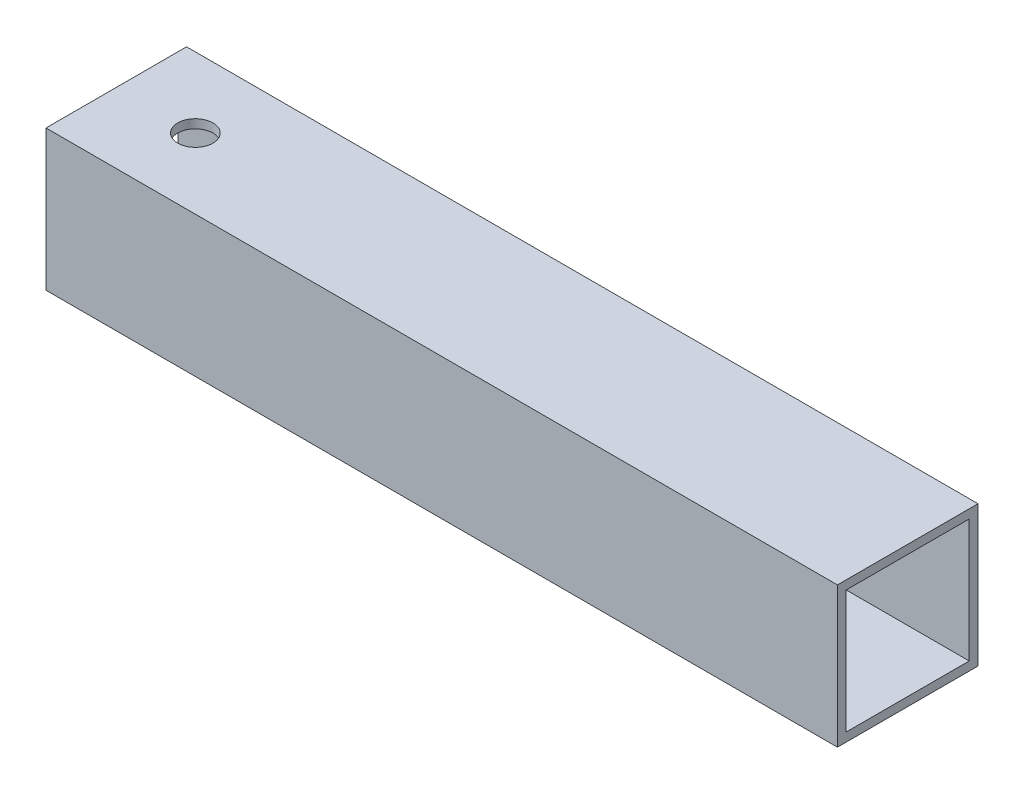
ISO-10303-21;
HEADER;
FILE_DESCRIPTION(('STEP AP214'),'2;1');
FILE_NAME('part.step','',(''),(''),'','','');
FILE_SCHEMA(('AUTOMOTIVE_DESIGN { 1 0 10303 214 1 1 1 1 }'));
ENDSEC;
DATA;
#1=APPLICATION_CONTEXT('core data for automotive mechanical design processes');
#2=APPLICATION_PROTOCOL_DEFINITION('international standard','automotive_design',2000,#1);
#3=PRODUCT_CONTEXT('',#1,'mechanical');
#4=PRODUCT('Part','Part','',(#3));
#5=PRODUCT_RELATED_PRODUCT_CATEGORY('part','',(#4));
#6=PRODUCT_DEFINITION_FORMATION('','',#4);
#7=PRODUCT_DEFINITION_CONTEXT('part definition',#1,'design');
#8=PRODUCT_DEFINITION('design','',#6,#7);
#9=PRODUCT_DEFINITION_SHAPE('','',#8);
#10=(LENGTH_UNIT() NAMED_UNIT(*) SI_UNIT(.MILLI.,.METRE.));
#11=(NAMED_UNIT(*) PLANE_ANGLE_UNIT() SI_UNIT($,.RADIAN.));
#12=(NAMED_UNIT(*) SI_UNIT($,.STERADIAN.) SOLID_ANGLE_UNIT());
#13=UNCERTAINTY_MEASURE_WITH_UNIT(LENGTH_MEASURE(1.E-05),#10,'distance_accuracy_value','');
#14=(GEOMETRIC_REPRESENTATION_CONTEXT(3) GLOBAL_UNCERTAINTY_ASSIGNED_CONTEXT((#13)) GLOBAL_UNIT_ASSIGNED_CONTEXT((#10,
#11,#12)) REPRESENTATION_CONTEXT('',''));
#15=CARTESIAN_POINT('',(0.,0.,0.));
#16=DIRECTION('',(0.,0.,1.));
#17=DIRECTION('',(1.,0.,0.));
#18=AXIS2_PLACEMENT_3D('',#15,#16,#17);
#19=CARTESIAN_POINT('',(143.002,0.,0.));
#20=DIRECTION('',(1.,0.,0.));
#21=DIRECTION('',(0.,0.,-1.));
#22=AXIS2_PLACEMENT_3D('',#19,#20,#21);
#23=PLANE('',#22);
#24=DIRECTION('',(0.,-1.,0.));
#25=VECTOR('',#24,1.);
#26=CARTESIAN_POINT('',(143.002,-12.7,12.7));
#27=LINE('',#26,#25);
#28=CARTESIAN_POINT('',(143.002,12.7,12.7));
#29=VERTEX_POINT('',#28);
#30=CARTESIAN_POINT('',(143.002,-12.7,12.7));
#31=VERTEX_POINT('',#30);
#32=EDGE_CURVE('E137',#29,#31,#27,.T.);
#33=ORIENTED_EDGE('',*,*,#32,.T.);
#34=DIRECTION('',(0.,0.,-1.));
#35=VECTOR('',#34,1.);
#36=CARTESIAN_POINT('',(143.002,-12.7,-12.7));
#37=LINE('',#36,#35);
#38=CARTESIAN_POINT('',(143.002,-12.7,-12.7));
#39=VERTEX_POINT('',#38);
#40=EDGE_CURVE('E140',#31,#39,#37,.T.);
#41=ORIENTED_EDGE('',*,*,#40,.T.);
#42=DIRECTION('',(0.,1.,0.));
#43=VECTOR('',#42,1.);
#44=CARTESIAN_POINT('',(143.002,-12.7,-12.7));
#45=LINE('',#44,#43);
#46=CARTESIAN_POINT('',(143.002,12.7,-12.7));
#47=VERTEX_POINT('',#46);
#48=EDGE_CURVE('E143',#39,#47,#45,.T.);
#49=ORIENTED_EDGE('',*,*,#48,.T.);
#50=DIRECTION('',(0.,0.,1.));
#51=VECTOR('',#50,1.);
#52=CARTESIAN_POINT('',(143.002,12.7,-12.7));
#53=LINE('',#52,#51);
#54=EDGE_CURVE('E145',#47,#29,#53,.T.);
#55=ORIENTED_EDGE('',*,*,#54,.T.);
#56=EDGE_LOOP('',(#33,#41,#49,#55));
#57=FACE_BOUND('',#56,.T.);
#58=DIRECTION('',(0.,0.,-1.));
#59=VECTOR('',#58,1.);
#60=CARTESIAN_POINT('',(143.002,-11.1125,-11.1125));
#61=LINE('',#60,#59);
#62=CARTESIAN_POINT('',(143.002,-11.1125,11.1125));
#63=VERTEX_POINT('',#62);
#64=CARTESIAN_POINT('',(143.002,-11.1125,-11.1125));
#65=VERTEX_POINT('',#64);
#66=EDGE_CURVE('E107',#63,#65,#61,.T.);
#67=ORIENTED_EDGE('',*,*,#66,.F.);
#68=DIRECTION('',(0.,-1.,0.));
#69=VECTOR('',#68,1.);
#70=CARTESIAN_POINT('',(143.002,-11.1125,11.1125));
#71=LINE('',#70,#69);
#72=CARTESIAN_POINT('',(143.002,11.1125,11.1125));
#73=VERTEX_POINT('',#72);
#74=EDGE_CURVE('E99',#73,#63,#71,.T.);
#75=ORIENTED_EDGE('',*,*,#74,.F.);
#76=DIRECTION('',(0.,0.,1.));
#77=VECTOR('',#76,1.);
#78=CARTESIAN_POINT('',(143.002,11.1125,-11.1125));
#79=LINE('',#78,#77);
#80=CARTESIAN_POINT('',(143.002,11.1125,-11.1125));
#81=VERTEX_POINT('',#80);
#82=EDGE_CURVE('E121',#81,#73,#79,.T.);
#83=ORIENTED_EDGE('',*,*,#82,.F.);
#84=DIRECTION('',(0.,1.,0.));
#85=VECTOR('',#84,1.);
#86=CARTESIAN_POINT('',(143.002,-11.1125,-11.1125));
#87=LINE('',#86,#85);
#88=EDGE_CURVE('E119',#65,#81,#87,.T.);
#89=ORIENTED_EDGE('',*,*,#88,.F.);
#90=EDGE_LOOP('',(#67,#75,#83,#89));
#91=FACE_BOUND('',#90,.T.);
#92=ADVANCED_FACE('F33',(#57,#91),#23,.T.);
#93=CARTESIAN_POINT('',(0.,0.,0.));
#94=DIRECTION('',(1.,0.,0.));
#95=DIRECTION('',(0.,0.,-1.));
#96=AXIS2_PLACEMENT_3D('',#93,#94,#95);
#97=PLANE('',#96);
#98=DIRECTION('',(0.,-1.,0.));
#99=VECTOR('',#98,1.);
#100=CARTESIAN_POINT('',(0.,-12.7,12.7));
#101=LINE('',#100,#99);
#102=CARTESIAN_POINT('',(0.,12.7,12.7));
#103=VERTEX_POINT('',#102);
#104=CARTESIAN_POINT('',(0.,-12.7,12.7));
#105=VERTEX_POINT('',#104);
#106=EDGE_CURVE('E115',#103,#105,#101,.T.);
#107=ORIENTED_EDGE('',*,*,#106,.F.);
#108=DIRECTION('',(0.,0.,1.));
#109=VECTOR('',#108,1.);
#110=CARTESIAN_POINT('',(0.,12.7,-12.7));
#111=LINE('',#110,#109);
#112=CARTESIAN_POINT('',(0.,12.7,-12.7));
#113=VERTEX_POINT('',#112);
#114=EDGE_CURVE('E141',#113,#103,#111,.T.);
#115=ORIENTED_EDGE('',*,*,#114,.F.);
#116=DIRECTION('',(0.,1.,0.));
#117=VECTOR('',#116,1.);
#118=CARTESIAN_POINT('',(0.,-12.7,-12.7));
#119=LINE('',#118,#117);
#120=CARTESIAN_POINT('',(0.,-12.7,-12.7));
#121=VERTEX_POINT('',#120);
#122=EDGE_CURVE('E152',#121,#113,#119,.T.);
#123=ORIENTED_EDGE('',*,*,#122,.F.);
#124=DIRECTION('',(0.,0.,-1.));
#125=VECTOR('',#124,1.);
#126=CARTESIAN_POINT('',(0.,-12.7,-12.7));
#127=LINE('',#126,#125);
#128=EDGE_CURVE('E150',#105,#121,#127,.T.);
#129=ORIENTED_EDGE('',*,*,#128,.F.);
#130=EDGE_LOOP('',(#107,#115,#123,#129));
#131=FACE_BOUND('',#130,.T.);
#132=DIRECTION('',(0.,-1.,0.));
#133=VECTOR('',#132,1.);
#134=CARTESIAN_POINT('',(0.,-11.1125,11.1125));
#135=LINE('',#134,#133);
#136=CARTESIAN_POINT('',(0.,11.1125,11.1125));
#137=VERTEX_POINT('',#136);
#138=CARTESIAN_POINT('',(0.,-11.1125,11.1125));
#139=VERTEX_POINT('',#138);
#140=EDGE_CURVE('E57',#137,#139,#135,.T.);
#141=ORIENTED_EDGE('',*,*,#140,.T.);
#142=DIRECTION('',(0.,0.,-1.));
#143=VECTOR('',#142,1.);
#144=CARTESIAN_POINT('',(0.,-11.1125,-11.1125));
#145=LINE('',#144,#143);
#146=CARTESIAN_POINT('',(0.,-11.1125,-11.1125));
#147=VERTEX_POINT('',#146);
#148=EDGE_CURVE('E114',#139,#147,#145,.T.);
#149=ORIENTED_EDGE('',*,*,#148,.T.);
#150=DIRECTION('',(0.,1.,0.));
#151=VECTOR('',#150,1.);
#152=CARTESIAN_POINT('',(0.,-11.1125,-11.1125));
#153=LINE('',#152,#151);
#154=CARTESIAN_POINT('',(0.,11.1125,-11.1125));
#155=VERTEX_POINT('',#154);
#156=EDGE_CURVE('E129',#147,#155,#153,.T.);
#157=ORIENTED_EDGE('',*,*,#156,.T.);
#158=DIRECTION('',(0.,0.,1.));
#159=VECTOR('',#158,1.);
#160=CARTESIAN_POINT('',(0.,11.1125,-11.1125));
#161=LINE('',#160,#159);
#162=EDGE_CURVE('E108',#155,#137,#161,.T.);
#163=ORIENTED_EDGE('',*,*,#162,.T.);
#164=EDGE_LOOP('',(#141,#149,#157,#163));
#165=FACE_BOUND('',#164,.T.);
#166=ADVANCED_FACE('F171',(#131,#165),#97,.F.);
#167=CARTESIAN_POINT('',(143.002,-12.7,12.7));
#168=DIRECTION('',(0.,0.,-1.));
#169=DIRECTION('',(-1.,0.,0.));
#170=AXIS2_PLACEMENT_3D('',#167,#168,#169);
#171=PLANE('',#170);
#172=ORIENTED_EDGE('',*,*,#106,.T.);
#173=DIRECTION('',(-1.,0.,0.));
#174=VECTOR('',#173,1.);
#175=CARTESIAN_POINT('',(143.002,-12.7,12.7));
#176=LINE('',#175,#174);
#177=EDGE_CURVE('E11',#31,#105,#176,.T.);
#178=ORIENTED_EDGE('',*,*,#177,.F.);
#179=ORIENTED_EDGE('',*,*,#32,.F.);
#180=DIRECTION('',(-1.,0.,0.));
#181=VECTOR('',#180,1.);
#182=CARTESIAN_POINT('',(143.002,12.7,12.7));
#183=LINE('',#182,#181);
#184=EDGE_CURVE('E147',#29,#103,#183,.T.);
#185=ORIENTED_EDGE('',*,*,#184,.T.);
#186=EDGE_LOOP('',(#172,#178,#179,#185));
#187=FACE_BOUND('',#186,.T.);
#188=ADVANCED_FACE('F35',(#187),#171,.F.);
#189=CARTESIAN_POINT('',(143.002,-12.7,-12.7));
#190=DIRECTION('',(0.,1.,0.));
#191=DIRECTION('',(0.,0.,1.));
#192=AXIS2_PLACEMENT_3D('',#189,#190,#191);
#193=PLANE('',#192);
#194=CARTESIAN_POINT('',(14.2875,-12.7,0.));
#195=DIRECTION('',(0.,1.,0.));
#196=DIRECTION('',(0.,0.,1.));
#197=AXIS2_PLACEMENT_3D('',#194,#195,#196);
#198=CIRCLE('',#197,3.175);
#199=CARTESIAN_POINT('',(14.2875,-12.7,3.175));
#200=VERTEX_POINT('',#199);
#201=EDGE_CURVE('E127',#200,#200,#198,.T.);
#202=ORIENTED_EDGE('',*,*,#201,.T.);
#203=EDGE_LOOP('',(#202));
#204=FACE_BOUND('',#203,.T.);
#205=ORIENTED_EDGE('',*,*,#128,.T.);
#206=DIRECTION('',(-1.,0.,0.));
#207=VECTOR('',#206,1.);
#208=CARTESIAN_POINT('',(143.002,-12.7,-12.7));
#209=LINE('',#208,#207);
#210=EDGE_CURVE('E42',#39,#121,#209,.T.);
#211=ORIENTED_EDGE('',*,*,#210,.F.);
#212=ORIENTED_EDGE('',*,*,#40,.F.);
#213=ORIENTED_EDGE('',*,*,#177,.T.);
#214=EDGE_LOOP('',(#205,#211,#212,#213));
#215=FACE_BOUND('',#214,.T.);
#216=ADVANCED_FACE('F181',(#204,#215),#193,.F.);
#217=CARTESIAN_POINT('',(143.002,-12.7,-12.7));
#218=DIRECTION('',(0.,0.,1.));
#219=DIRECTION('',(1.,0.,0.));
#220=AXIS2_PLACEMENT_3D('',#217,#218,#219);
#221=PLANE('',#220);
#222=ORIENTED_EDGE('',*,*,#122,.T.);
#223=DIRECTION('',(-1.,0.,0.));
#224=VECTOR('',#223,1.);
#225=CARTESIAN_POINT('',(143.002,12.7,-12.7));
#226=LINE('',#225,#224);
#227=EDGE_CURVE('E157',#47,#113,#226,.T.);
#228=ORIENTED_EDGE('',*,*,#227,.F.);
#229=ORIENTED_EDGE('',*,*,#48,.F.);
#230=ORIENTED_EDGE('',*,*,#210,.T.);
#231=EDGE_LOOP('',(#222,#228,#229,#230));
#232=FACE_BOUND('',#231,.T.);
#233=ADVANCED_FACE('F165',(#232),#221,.F.);
#234=CARTESIAN_POINT('',(143.002,12.7,-12.7));
#235=DIRECTION('',(0.,-1.,0.));
#236=DIRECTION('',(0.,0.,-1.));
#237=AXIS2_PLACEMENT_3D('',#234,#235,#236);
#238=PLANE('',#237);
#239=CARTESIAN_POINT('',(14.2875,12.7,0.));
#240=DIRECTION('',(0.,1.,0.));
#241=DIRECTION('',(0.,0.,1.));
#242=AXIS2_PLACEMENT_3D('',#239,#240,#241);
#243=CIRCLE('',#242,3.175);
#244=CARTESIAN_POINT('',(14.2875,12.7,3.17500000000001));
#245=VERTEX_POINT('',#244);
#246=EDGE_CURVE('E206',#245,#245,#243,.T.);
#247=ORIENTED_EDGE('',*,*,#246,.F.);
#248=EDGE_LOOP('',(#247));
#249=FACE_BOUND('',#248,.T.);
#250=ORIENTED_EDGE('',*,*,#114,.T.);
#251=ORIENTED_EDGE('',*,*,#184,.F.);
#252=ORIENTED_EDGE('',*,*,#54,.F.);
#253=ORIENTED_EDGE('',*,*,#227,.T.);
#254=EDGE_LOOP('',(#250,#251,#252,#253));
#255=FACE_BOUND('',#254,.T.);
#256=ADVANCED_FACE('F175',(#249,#255),#238,.F.);
#257=CARTESIAN_POINT('',(143.002,-11.1125,11.1125));
#258=DIRECTION('',(0.,0.,-1.));
#259=DIRECTION('',(-1.,0.,0.));
#260=AXIS2_PLACEMENT_3D('',#257,#258,#259);
#261=PLANE('',#260);
#262=ORIENTED_EDGE('',*,*,#140,.F.);
#263=DIRECTION('',(-1.,0.,0.));
#264=VECTOR('',#263,1.);
#265=CARTESIAN_POINT('',(143.002,11.1125,11.1125));
#266=LINE('',#265,#264);
#267=EDGE_CURVE('E103',#73,#137,#266,.T.);
#268=ORIENTED_EDGE('',*,*,#267,.F.);
#269=ORIENTED_EDGE('',*,*,#74,.T.);
#270=DIRECTION('',(-1.,0.,0.));
#271=VECTOR('',#270,1.);
#272=CARTESIAN_POINT('',(143.002,-11.1125,11.1125));
#273=LINE('',#272,#271);
#274=EDGE_CURVE('E102',#63,#139,#273,.T.);
#275=ORIENTED_EDGE('',*,*,#274,.T.);
#276=EDGE_LOOP('',(#262,#268,#269,#275));
#277=FACE_BOUND('',#276,.T.);
#278=ADVANCED_FACE('F101',(#277),#261,.T.);
#279=CARTESIAN_POINT('',(143.002,-11.1125,-11.1125));
#280=DIRECTION('',(0.,1.,0.));
#281=DIRECTION('',(0.,0.,1.));
#282=AXIS2_PLACEMENT_3D('',#279,#280,#281);
#283=PLANE('',#282);
#284=CARTESIAN_POINT('',(14.2875,-11.1125,0.));
#285=DIRECTION('',(0.,1.,0.));
#286=DIRECTION('',(0.,0.,1.));
#287=AXIS2_PLACEMENT_3D('',#284,#285,#286);
#288=CIRCLE('',#287,3.175);
#289=CARTESIAN_POINT('',(14.2875,-11.1125,3.175));
#290=VERTEX_POINT('',#289);
#291=EDGE_CURVE('E210',#290,#290,#288,.T.);
#292=ORIENTED_EDGE('',*,*,#291,.F.);
#293=EDGE_LOOP('',(#292));
#294=FACE_BOUND('',#293,.T.);
#295=ORIENTED_EDGE('',*,*,#148,.F.);
#296=ORIENTED_EDGE('',*,*,#274,.F.);
#297=ORIENTED_EDGE('',*,*,#66,.T.);
#298=DIRECTION('',(-1.,0.,0.));
#299=VECTOR('',#298,1.);
#300=CARTESIAN_POINT('',(143.002,-11.1125,-11.1125));
#301=LINE('',#300,#299);
#302=EDGE_CURVE('E116',#65,#147,#301,.T.);
#303=ORIENTED_EDGE('',*,*,#302,.T.);
#304=EDGE_LOOP('',(#295,#296,#297,#303));
#305=FACE_BOUND('',#304,.T.);
#306=ADVANCED_FACE('F111',(#294,#305),#283,.T.);
#307=CARTESIAN_POINT('',(143.002,-11.1125,-11.1125));
#308=DIRECTION('',(0.,0.,1.));
#309=DIRECTION('',(1.,0.,0.));
#310=AXIS2_PLACEMENT_3D('',#307,#308,#309);
#311=PLANE('',#310);
#312=ORIENTED_EDGE('',*,*,#156,.F.);
#313=ORIENTED_EDGE('',*,*,#302,.F.);
#314=ORIENTED_EDGE('',*,*,#88,.T.);
#315=DIRECTION('',(-1.,0.,0.));
#316=VECTOR('',#315,1.);
#317=CARTESIAN_POINT('',(143.002,11.1125,-11.1125));
#318=LINE('',#317,#316);
#319=EDGE_CURVE('E49',#81,#155,#318,.T.);
#320=ORIENTED_EDGE('',*,*,#319,.T.);
#321=EDGE_LOOP('',(#312,#313,#314,#320));
#322=FACE_BOUND('',#321,.T.);
#323=ADVANCED_FACE('F228',(#322),#311,.T.);
#324=CARTESIAN_POINT('',(143.002,11.1125,-11.1125));
#325=DIRECTION('',(0.,-1.,0.));
#326=DIRECTION('',(0.,0.,-1.));
#327=AXIS2_PLACEMENT_3D('',#324,#325,#326);
#328=PLANE('',#327);
#329=CARTESIAN_POINT('',(14.2875,11.1125,0.));
#330=DIRECTION('',(0.,-1.,0.));
#331=DIRECTION('',(0.,0.,-1.));
#332=AXIS2_PLACEMENT_3D('',#329,#330,#331);
#333=CIRCLE('',#332,3.175);
#334=CARTESIAN_POINT('',(14.2875,11.1125,-3.175));
#335=VERTEX_POINT('',#334);
#336=EDGE_CURVE('E37',#335,#335,#333,.T.);
#337=ORIENTED_EDGE('',*,*,#336,.F.);
#338=EDGE_LOOP('',(#337));
#339=FACE_BOUND('',#338,.T.);
#340=ORIENTED_EDGE('',*,*,#162,.F.);
#341=ORIENTED_EDGE('',*,*,#319,.F.);
#342=ORIENTED_EDGE('',*,*,#82,.T.);
#343=ORIENTED_EDGE('',*,*,#267,.T.);
#344=EDGE_LOOP('',(#340,#341,#342,#343));
#345=FACE_BOUND('',#344,.T.);
#346=ADVANCED_FACE('F223',(#339,#345),#328,.T.);
#347=CARTESIAN_POINT('',(14.2875,-130.302,0.));
#348=DIRECTION('',(0.,1.,0.));
#349=DIRECTION('',(0.,0.,1.));
#350=AXIS2_PLACEMENT_3D('',#347,#348,#349);
#351=CYLINDRICAL_SURFACE('',#350,3.175);
#352=ORIENTED_EDGE('',*,*,#336,.T.);
#353=EDGE_LOOP('',(#352));
#354=FACE_BOUND('',#353,.T.);
#355=ORIENTED_EDGE('',*,*,#246,.T.);
#356=EDGE_LOOP('',(#355));
#357=FACE_BOUND('',#356,.T.);
#358=ADVANCED_FACE('F217',(#354,#357),#351,.F.);
#359=ORIENTED_EDGE('',*,*,#291,.T.);
#360=EDGE_LOOP('',(#359));
#361=FACE_BOUND('',#360,.T.);
#362=ORIENTED_EDGE('',*,*,#201,.F.);
#363=EDGE_LOOP('',(#362));
#364=FACE_BOUND('',#363,.T.);
#365=ADVANCED_FACE('F215',(#361,#364),#351,.F.);
#366=CLOSED_SHELL('',(#92,#166,#188,#216,#233,#256,#278,#306,#323,#346,#358,#365));
#367=MANIFOLD_SOLID_BREP('B2',#366);
#368=ADVANCED_BREP_SHAPE_REPRESENTATION('',(#18,#367),#14);
#369=SHAPE_DEFINITION_REPRESENTATION(#9,#368);
ENDSEC;
END-ISO-10303-21;
